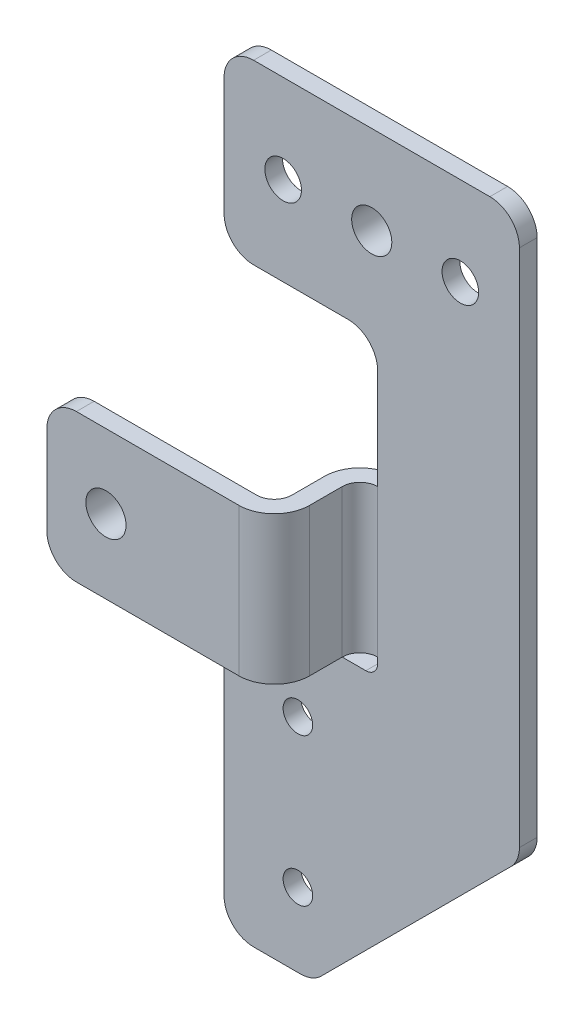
ISO-10303-21;
HEADER;
FILE_DESCRIPTION(('STEP AP214'),'2;1');
FILE_NAME('part.step','',(''),(''),'','','');
FILE_SCHEMA(('AUTOMOTIVE_DESIGN { 1 0 10303 214 1 1 1 1 }'));
ENDSEC;
DATA;
#1=APPLICATION_CONTEXT('core data for automotive mechanical design processes');
#2=APPLICATION_PROTOCOL_DEFINITION('international standard','automotive_design',2000,#1);
#3=PRODUCT_CONTEXT('',#1,'mechanical');
#4=PRODUCT('Part','Part','',(#3));
#5=PRODUCT_RELATED_PRODUCT_CATEGORY('part','',(#4));
#6=PRODUCT_DEFINITION_FORMATION('','',#4);
#7=PRODUCT_DEFINITION_CONTEXT('part definition',#1,'design');
#8=PRODUCT_DEFINITION('design','',#6,#7);
#9=PRODUCT_DEFINITION_SHAPE('','',#8);
#10=(LENGTH_UNIT() NAMED_UNIT(*) SI_UNIT(.MILLI.,.METRE.));
#11=(NAMED_UNIT(*) PLANE_ANGLE_UNIT() SI_UNIT($,.RADIAN.));
#12=(NAMED_UNIT(*) SI_UNIT($,.STERADIAN.) SOLID_ANGLE_UNIT());
#13=UNCERTAINTY_MEASURE_WITH_UNIT(LENGTH_MEASURE(1.E-05),#10,'distance_accuracy_value','');
#14=(GEOMETRIC_REPRESENTATION_CONTEXT(3) GLOBAL_UNCERTAINTY_ASSIGNED_CONTEXT((#13)) GLOBAL_UNIT_ASSIGNED_CONTEXT((#10,
#11,#12)) REPRESENTATION_CONTEXT('',''));
#15=CARTESIAN_POINT('',(0.,0.,0.));
#16=DIRECTION('',(0.,0.,1.));
#17=DIRECTION('',(1.,0.,0.));
#18=AXIS2_PLACEMENT_3D('',#15,#16,#17);
#19=CARTESIAN_POINT('',(74.0000000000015,40.5,1067.));
#20=DIRECTION('',(0.,0.,-1.));
#21=DIRECTION('',(-1.,0.,0.));
#22=AXIS2_PLACEMENT_3D('',#19,#20,#21);
#23=CYLINDRICAL_SURFACE('',#22,6.);
#24=CARTESIAN_POINT('',(74.0000000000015,40.5,1067.));
#25=DIRECTION('',(0.,0.,-1.));
#26=DIRECTION('',(-1.,0.,0.));
#27=AXIS2_PLACEMENT_3D('',#24,#25,#26);
#28=CIRCLE('',#27,6.);
#29=CARTESIAN_POINT('',(68.0000000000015,40.5,1067.));
#30=VERTEX_POINT('',#29);
#31=EDGE_CURVE('E244',#30,#30,#28,.F.);
#32=ORIENTED_EDGE('',*,*,#31,.F.);
#33=EDGE_LOOP('',(#32));
#34=FACE_BOUND('',#33,.T.);
#35=CARTESIAN_POINT('',(74.0000000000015,40.5,1063.));
#36=DIRECTION('',(0.,0.,-1.));
#37=DIRECTION('',(-1.,0.,0.));
#38=AXIS2_PLACEMENT_3D('',#35,#36,#37);
#39=CIRCLE('',#38,6.);
#40=CARTESIAN_POINT('',(68.0000000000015,40.5,1063.));
#41=VERTEX_POINT('',#40);
#42=EDGE_CURVE('E20',#41,#41,#39,.T.);
#43=ORIENTED_EDGE('',*,*,#42,.F.);
#44=EDGE_LOOP('',(#43));
#45=FACE_BOUND('',#44,.T.);
#46=ADVANCED_FACE('F17',(#34,#45),#23,.T.);
#47=CARTESIAN_POINT('',(74.0000000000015,40.5,1063.));
#48=DIRECTION('',(0.,0.,-1.));
#49=DIRECTION('',(-1.,0.,0.));
#50=AXIS2_PLACEMENT_3D('',#47,#48,#49);
#51=PLANE('',#50);
#52=ORIENTED_EDGE('',*,*,#42,.T.);
#53=EDGE_LOOP('',(#52));
#54=FACE_BOUND('',#53,.T.);
#55=CARTESIAN_POINT('',(74.0000000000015,40.5,1063.));
#56=DIRECTION('',(0.,0.,1.));
#57=DIRECTION('',(1.,0.,0.));
#58=AXIS2_PLACEMENT_3D('',#55,#56,#57);
#59=CIRCLE('',#58,3.4);
#60=CARTESIAN_POINT('',(77.4000000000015,40.5,1063.));
#61=VERTEX_POINT('',#60);
#62=EDGE_CURVE('E222',#61,#61,#59,.T.);
#63=ORIENTED_EDGE('',*,*,#62,.T.);
#64=EDGE_LOOP('',(#63));
#65=FACE_BOUND('',#64,.T.);
#66=ADVANCED_FACE('F250',(#54,#65),#51,.T.);
#67=CARTESIAN_POINT('',(96.5000000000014,28.,1067.));
#68=DIRECTION('',(0.,0.,-1.));
#69=DIRECTION('',(-1.,0.,0.));
#70=AXIS2_PLACEMENT_3D('',#67,#68,#69);
#71=PLANE('',#70);
#72=DIRECTION('',(1.,0.,0.));
#73=VECTOR('',#72,1.);
#74=CARTESIAN_POINT('',(96.5000000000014,53.,1067.));
#75=LINE('',#74,#73);
#76=CARTESIAN_POINT('',(96.5000000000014,53.,1067.));
#77=VERTEX_POINT('',#76);
#78=CARTESIAN_POINT('',(69.0000000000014,53.,1067.));
#79=VERTEX_POINT('',#78);
#80=EDGE_CURVE('E846',#77,#79,#75,.F.);
#81=ORIENTED_EDGE('',*,*,#80,.F.);
#82=DIRECTION('',(0.,-1.,0.));
#83=VECTOR('',#82,1.);
#84=CARTESIAN_POINT('',(96.5000000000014,28.,1067.));
#85=LINE('',#84,#83);
#86=CARTESIAN_POINT('',(96.5000000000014,28.,1067.));
#87=VERTEX_POINT('',#86);
#88=EDGE_CURVE('E697',#77,#87,#85,.T.);
#89=ORIENTED_EDGE('',*,*,#88,.T.);
#90=DIRECTION('',(1.,0.,0.));
#91=VECTOR('',#90,1.);
#92=CARTESIAN_POINT('',(96.5000000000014,28.,1067.));
#93=LINE('',#92,#91);
#94=CARTESIAN_POINT('',(69.0000000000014,28.,1067.));
#95=VERTEX_POINT('',#94);
#96=EDGE_CURVE('E237',#95,#87,#93,.T.);
#97=ORIENTED_EDGE('',*,*,#96,.F.);
#98=CARTESIAN_POINT('',(69.0000000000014,33.,1067.));
#99=DIRECTION('',(0.,0.,-1.));
#100=DIRECTION('',(-1.,0.,0.));
#101=AXIS2_PLACEMENT_3D('',#98,#99,#100);
#102=CIRCLE('',#101,5.);
#103=CARTESIAN_POINT('',(64.0000000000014,33.,1067.));
#104=VERTEX_POINT('',#103);
#105=EDGE_CURVE('E228',#104,#95,#102,.F.);
#106=ORIENTED_EDGE('',*,*,#105,.F.);
#107=DIRECTION('',(0.,1.,0.));
#108=VECTOR('',#107,1.);
#109=CARTESIAN_POINT('',(64.0000000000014,53.,1067.));
#110=LINE('',#109,#108);
#111=CARTESIAN_POINT('',(64.0000000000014,48.,1067.));
#112=VERTEX_POINT('',#111);
#113=EDGE_CURVE('E212',#112,#104,#110,.F.);
#114=ORIENTED_EDGE('',*,*,#113,.F.);
#115=CARTESIAN_POINT('',(69.0000000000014,48.,1067.));
#116=DIRECTION('',(0.,0.,1.));
#117=DIRECTION('',(1.,0.,0.));
#118=AXIS2_PLACEMENT_3D('',#115,#116,#117);
#119=CIRCLE('',#118,5.);
#120=EDGE_CURVE('E238',#79,#112,#119,.T.);
#121=ORIENTED_EDGE('',*,*,#120,.F.);
#122=EDGE_LOOP('',(#81,#89,#97,#106,#114,#121));
#123=FACE_BOUND('',#122,.T.);
#124=ORIENTED_EDGE('',*,*,#31,.T.);
#125=EDGE_LOOP('',(#124));
#126=FACE_BOUND('',#125,.T.);
#127=ADVANCED_FACE('F234',(#123,#126),#71,.T.);
#128=CARTESIAN_POINT('',(74.0000000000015,40.5,1063.));
#129=DIRECTION('',(0.,0.,1.));
#130=DIRECTION('',(1.,0.,0.));
#131=AXIS2_PLACEMENT_3D('',#128,#129,#130);
#132=CYLINDRICAL_SURFACE('',#131,3.4);
#133=ORIENTED_EDGE('',*,*,#62,.F.);
#134=EDGE_LOOP('',(#133));
#135=FACE_BOUND('',#134,.T.);
#136=CARTESIAN_POINT('',(74.0000000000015,40.5,1070.));
#137=DIRECTION('',(0.,0.,1.));
#138=DIRECTION('',(1.,0.,0.));
#139=AXIS2_PLACEMENT_3D('',#136,#137,#138);
#140=CIRCLE('',#139,3.4);
#141=CARTESIAN_POINT('',(77.4000000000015,40.5,1070.));
#142=VERTEX_POINT('',#141);
#143=EDGE_CURVE('E694',#142,#142,#140,.F.);
#144=ORIENTED_EDGE('',*,*,#143,.F.);
#145=EDGE_LOOP('',(#144));
#146=FACE_BOUND('',#145,.T.);
#147=ADVANCED_FACE('F418',(#135,#146),#132,.F.);
#148=CARTESIAN_POINT('',(64.0000000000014,53.,1067.));
#149=DIRECTION('',(-1.,0.,0.));
#150=DIRECTION('',(0.,0.,1.));
#151=AXIS2_PLACEMENT_3D('',#148,#149,#150);
#152=PLANE('',#151);
#153=DIRECTION('',(0.,1.,0.));
#154=VECTOR('',#153,1.);
#155=CARTESIAN_POINT('',(64.0000000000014,53.,1070.));
#156=LINE('',#155,#154);
#157=CARTESIAN_POINT('',(64.0000000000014,48.,1070.));
#158=VERTEX_POINT('',#157);
#159=CARTESIAN_POINT('',(64.0000000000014,33.,1070.));
#160=VERTEX_POINT('',#159);
#161=EDGE_CURVE('E696',#158,#160,#156,.F.);
#162=ORIENTED_EDGE('',*,*,#161,.F.);
#163=DIRECTION('',(0.,0.,1.));
#164=VECTOR('',#163,1.);
#165=CARTESIAN_POINT('',(64.0000000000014,48.,1067.));
#166=LINE('',#165,#164);
#167=EDGE_CURVE('E218',#112,#158,#166,.T.);
#168=ORIENTED_EDGE('',*,*,#167,.F.);
#169=ORIENTED_EDGE('',*,*,#113,.T.);
#170=DIRECTION('',(0.,0.,-1.));
#171=VECTOR('',#170,1.);
#172=CARTESIAN_POINT('',(64.0000000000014,33.,1070.));
#173=LINE('',#172,#171);
#174=EDGE_CURVE('E216',#160,#104,#173,.T.);
#175=ORIENTED_EDGE('',*,*,#174,.F.);
#176=EDGE_LOOP('',(#162,#168,#169,#175));
#177=FACE_BOUND('',#176,.T.);
#178=ADVANCED_FACE('F215',(#177),#152,.T.);
#179=CARTESIAN_POINT('',(69.0000000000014,33.,1070.));
#180=DIRECTION('',(0.,0.,-1.));
#181=DIRECTION('',(-1.,0.,0.));
#182=AXIS2_PLACEMENT_3D('',#179,#180,#181);
#183=CYLINDRICAL_SURFACE('',#182,5.);
#184=ORIENTED_EDGE('',*,*,#105,.T.);
#185=DIRECTION('',(0.,0.,-1.));
#186=VECTOR('',#185,1.);
#187=CARTESIAN_POINT('',(69.0000000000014,28.,1070.));
#188=LINE('',#187,#186);
#189=CARTESIAN_POINT('',(69.0000000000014,28.,1070.));
#190=VERTEX_POINT('',#189);
#191=EDGE_CURVE('E843',#190,#95,#188,.T.);
#192=ORIENTED_EDGE('',*,*,#191,.F.);
#193=CARTESIAN_POINT('',(69.0000000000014,33.,1070.));
#194=DIRECTION('',(0.,0.,-1.));
#195=DIRECTION('',(-1.,0.,0.));
#196=AXIS2_PLACEMENT_3D('',#193,#194,#195);
#197=CIRCLE('',#196,5.);
#198=EDGE_CURVE('E230',#160,#190,#197,.F.);
#199=ORIENTED_EDGE('',*,*,#198,.F.);
#200=ORIENTED_EDGE('',*,*,#174,.T.);
#201=EDGE_LOOP('',(#184,#192,#199,#200));
#202=FACE_BOUND('',#201,.T.);
#203=ADVANCED_FACE('F226',(#202),#183,.T.);
#204=CARTESIAN_POINT('',(69.0000000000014,48.,1067.));
#205=DIRECTION('',(0.,0.,1.));
#206=DIRECTION('',(1.,0.,0.));
#207=AXIS2_PLACEMENT_3D('',#204,#205,#206);
#208=CYLINDRICAL_SURFACE('',#207,5.);
#209=CARTESIAN_POINT('',(69.0000000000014,48.,1070.));
#210=DIRECTION('',(0.,0.,1.));
#211=DIRECTION('',(1.,0.,0.));
#212=AXIS2_PLACEMENT_3D('',#209,#210,#211);
#213=CIRCLE('',#212,5.);
#214=CARTESIAN_POINT('',(69.0000000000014,53.,1070.));
#215=VERTEX_POINT('',#214);
#216=EDGE_CURVE('E704',#215,#158,#213,.T.);
#217=ORIENTED_EDGE('',*,*,#216,.F.);
#218=DIRECTION('',(0.,0.,1.));
#219=VECTOR('',#218,1.);
#220=CARTESIAN_POINT('',(69.0000000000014,53.,1067.));
#221=LINE('',#220,#219);
#222=EDGE_CURVE('E699',#79,#215,#221,.T.);
#223=ORIENTED_EDGE('',*,*,#222,.F.);
#224=ORIENTED_EDGE('',*,*,#120,.T.);
#225=ORIENTED_EDGE('',*,*,#167,.T.);
#226=EDGE_LOOP('',(#217,#223,#224,#225));
#227=FACE_BOUND('',#226,.T.);
#228=ADVANCED_FACE('F409',(#227),#208,.T.);
#229=CARTESIAN_POINT('',(96.5000000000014,28.,1064.));
#230=DIRECTION('',(0.,-1.,0.));
#231=DIRECTION('',(0.,0.,-1.));
#232=AXIS2_PLACEMENT_3D('',#229,#230,#231);
#233=CYLINDRICAL_SURFACE('',#232,3.);
#234=CARTESIAN_POINT('',(96.5000000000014,28.,1064.));
#235=DIRECTION('',(0.,-1.,0.));
#236=DIRECTION('',(0.,0.,-1.));
#237=AXIS2_PLACEMENT_3D('',#234,#235,#236);
#238=CIRCLE('',#237,3.);
#239=CARTESIAN_POINT('',(99.5000000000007,28.,1064.));
#240=VERTEX_POINT('',#239);
#241=EDGE_CURVE('E707',#87,#240,#238,.F.);
#242=ORIENTED_EDGE('',*,*,#241,.F.);
#243=ORIENTED_EDGE('',*,*,#88,.F.);
#244=CARTESIAN_POINT('',(96.5000000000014,53.,1064.));
#245=DIRECTION('',(0.,-1.,0.));
#246=DIRECTION('',(0.,0.,-1.));
#247=AXIS2_PLACEMENT_3D('',#244,#245,#246);
#248=CIRCLE('',#247,3.);
#249=CARTESIAN_POINT('',(99.5000000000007,53.,1064.));
#250=VERTEX_POINT('',#249);
#251=EDGE_CURVE('E710',#250,#77,#248,.T.);
#252=ORIENTED_EDGE('',*,*,#251,.F.);
#253=DIRECTION('',(0.,1.,0.));
#254=VECTOR('',#253,1.);
#255=CARTESIAN_POINT('',(99.5,28.,1064.));
#256=LINE('',#255,#254);
#257=EDGE_CURVE('E713',#240,#250,#256,.T.);
#258=ORIENTED_EDGE('',*,*,#257,.F.);
#259=EDGE_LOOP('',(#242,#243,#252,#258));
#260=FACE_BOUND('',#259,.T.);
#261=ADVANCED_FACE('F405',(#260),#233,.F.);
#262=CARTESIAN_POINT('',(96.5000000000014,53.,1070.));
#263=DIRECTION('',(0.,0.,1.));
#264=DIRECTION('',(1.,0.,0.));
#265=AXIS2_PLACEMENT_3D('',#262,#263,#264);
#266=PLANE('',#265);
#267=DIRECTION('',(1.,0.,0.));
#268=VECTOR('',#267,1.);
#269=CARTESIAN_POINT('',(96.5000000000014,53.,1070.));
#270=LINE('',#269,#268);
#271=CARTESIAN_POINT('',(96.5000000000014,53.,1070.));
#272=VERTEX_POINT('',#271);
#273=EDGE_CURVE('E708',#272,#215,#270,.F.);
#274=ORIENTED_EDGE('',*,*,#273,.T.);
#275=ORIENTED_EDGE('',*,*,#216,.T.);
#276=ORIENTED_EDGE('',*,*,#161,.T.);
#277=ORIENTED_EDGE('',*,*,#198,.T.);
#278=DIRECTION('',(1.,0.,0.));
#279=VECTOR('',#278,1.);
#280=CARTESIAN_POINT('',(96.5000000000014,28.,1070.));
#281=LINE('',#280,#279);
#282=CARTESIAN_POINT('',(96.5000000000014,28.,1070.));
#283=VERTEX_POINT('',#282);
#284=EDGE_CURVE('E703',#190,#283,#281,.T.);
#285=ORIENTED_EDGE('',*,*,#284,.T.);
#286=DIRECTION('',(0.,-1.,0.));
#287=VECTOR('',#286,1.);
#288=CARTESIAN_POINT('',(96.5000000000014,28.,1070.));
#289=LINE('',#288,#287);
#290=EDGE_CURVE('E716',#272,#283,#289,.T.);
#291=ORIENTED_EDGE('',*,*,#290,.F.);
#292=EDGE_LOOP('',(#274,#275,#276,#277,#285,#291));
#293=FACE_BOUND('',#292,.T.);
#294=ORIENTED_EDGE('',*,*,#143,.T.);
#295=EDGE_LOOP('',(#294));
#296=FACE_BOUND('',#295,.T.);
#297=ADVANCED_FACE('F401',(#293,#296),#266,.T.);
#298=CARTESIAN_POINT('',(99.5,28.,1058.5));
#299=DIRECTION('',(-1.,0.,0.));
#300=DIRECTION('',(0.,0.,1.));
#301=AXIS2_PLACEMENT_3D('',#298,#299,#300);
#302=PLANE('',#301);
#303=ORIENTED_EDGE('',*,*,#257,.T.);
#304=DIRECTION('',(0.,0.,1.));
#305=VECTOR('',#304,1.);
#306=CARTESIAN_POINT('',(99.5,53.,1058.5));
#307=LINE('',#306,#305);
#308=CARTESIAN_POINT('',(99.5,53.,1058.5));
#309=VERTEX_POINT('',#308);
#310=EDGE_CURVE('E857',#309,#250,#307,.T.);
#311=ORIENTED_EDGE('',*,*,#310,.F.);
#312=DIRECTION('',(0.,1.,0.));
#313=VECTOR('',#312,1.);
#314=CARTESIAN_POINT('',(99.5,53.,1058.5));
#315=LINE('',#314,#313);
#316=CARTESIAN_POINT('',(99.5000000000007,28.,1058.5));
#317=VERTEX_POINT('',#316);
#318=EDGE_CURVE('E724',#317,#309,#315,.T.);
#319=ORIENTED_EDGE('',*,*,#318,.F.);
#320=DIRECTION('',(0.,0.,-1.));
#321=VECTOR('',#320,1.);
#322=CARTESIAN_POINT('',(99.5000000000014,28.,1058.5));
#323=LINE('',#322,#321);
#324=EDGE_CURVE('E719',#240,#317,#323,.T.);
#325=ORIENTED_EDGE('',*,*,#324,.F.);
#326=EDGE_LOOP('',(#303,#311,#319,#325));
#327=FACE_BOUND('',#326,.T.);
#328=ADVANCED_FACE('F397',(#327),#302,.T.);
#329=CARTESIAN_POINT('',(96.5000000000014,28.,1064.));
#330=DIRECTION('',(0.,-1.,0.));
#331=DIRECTION('',(0.,0.,-1.));
#332=AXIS2_PLACEMENT_3D('',#329,#330,#331);
#333=CYLINDRICAL_SURFACE('',#332,6.);
#334=ORIENTED_EDGE('',*,*,#290,.T.);
#335=CARTESIAN_POINT('',(96.5000000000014,28.,1064.));
#336=DIRECTION('',(0.,-1.,0.));
#337=DIRECTION('',(0.,0.,-1.));
#338=AXIS2_PLACEMENT_3D('',#335,#336,#337);
#339=CIRCLE('',#338,6.);
#340=CARTESIAN_POINT('',(102.500000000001,28.,1064.));
#341=VERTEX_POINT('',#340);
#342=EDGE_CURVE('E717',#283,#341,#339,.F.);
#343=ORIENTED_EDGE('',*,*,#342,.T.);
#344=DIRECTION('',(0.,1.,0.));
#345=VECTOR('',#344,1.);
#346=CARTESIAN_POINT('',(102.5,53.,1064.));
#347=LINE('',#346,#345);
#348=CARTESIAN_POINT('',(102.500000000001,53.,1064.));
#349=VERTEX_POINT('',#348);
#350=EDGE_CURVE('E858',#349,#341,#347,.F.);
#351=ORIENTED_EDGE('',*,*,#350,.F.);
#352=CARTESIAN_POINT('',(96.5000000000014,53.,1064.));
#353=DIRECTION('',(0.,-1.,0.));
#354=DIRECTION('',(0.,0.,-1.));
#355=AXIS2_PLACEMENT_3D('',#352,#353,#354);
#356=CIRCLE('',#355,6.);
#357=EDGE_CURVE('E714',#349,#272,#356,.T.);
#358=ORIENTED_EDGE('',*,*,#357,.T.);
#359=EDGE_LOOP('',(#334,#343,#351,#358));
#360=FACE_BOUND('',#359,.T.);
#361=ADVANCED_FACE('F393',(#360),#333,.T.);
#362=CARTESIAN_POINT('',(105.5,53.,1058.5));
#363=DIRECTION('',(0.,1.,0.));
#364=DIRECTION('',(0.,0.,1.));
#365=AXIS2_PLACEMENT_3D('',#362,#363,#364);
#366=CYLINDRICAL_SURFACE('',#365,6.);
#367=ORIENTED_EDGE('',*,*,#318,.T.);
#368=CARTESIAN_POINT('',(105.5,53.,1058.5));
#369=DIRECTION('',(0.,1.,0.));
#370=DIRECTION('',(0.,0.,1.));
#371=AXIS2_PLACEMENT_3D('',#368,#369,#370);
#372=CIRCLE('',#371,6.);
#373=CARTESIAN_POINT('',(105.5,53.,1052.5));
#374=VERTEX_POINT('',#373);
#375=EDGE_CURVE('E727',#374,#309,#372,.T.);
#376=ORIENTED_EDGE('',*,*,#375,.F.);
#377=DIRECTION('',(0.,1.,0.));
#378=VECTOR('',#377,1.);
#379=CARTESIAN_POINT('',(105.5,53.,1052.5));
#380=LINE('',#379,#378);
#381=CARTESIAN_POINT('',(105.5,28.,1052.5));
#382=VERTEX_POINT('',#381);
#383=EDGE_CURVE('E735',#382,#374,#380,.T.);
#384=ORIENTED_EDGE('',*,*,#383,.F.);
#385=CARTESIAN_POINT('',(105.5,28.,1058.5));
#386=DIRECTION('',(0.,1.,0.));
#387=DIRECTION('',(0.,0.,1.));
#388=AXIS2_PLACEMENT_3D('',#385,#386,#387);
#389=CIRCLE('',#388,6.);
#390=EDGE_CURVE('E723',#317,#382,#389,.F.);
#391=ORIENTED_EDGE('',*,*,#390,.F.);
#392=EDGE_LOOP('',(#367,#376,#384,#391));
#393=FACE_BOUND('',#392,.T.);
#394=ADVANCED_FACE('F389',(#393),#366,.T.);
#395=CARTESIAN_POINT('',(104.5,90.,1052.5));
#396=DIRECTION('',(0.,0.,-1.));
#397=DIRECTION('',(-1.,0.,0.));
#398=AXIS2_PLACEMENT_3D('',#395,#396,#397);
#399=CYLINDRICAL_SURFACE('',#398,6.);
#400=CARTESIAN_POINT('',(104.5,90.,1052.5));
#401=DIRECTION('',(0.,0.,-1.));
#402=DIRECTION('',(-1.,0.,0.));
#403=AXIS2_PLACEMENT_3D('',#400,#401,#402);
#404=CIRCLE('',#403,6.);
#405=CARTESIAN_POINT('',(98.5,90.,1052.5));
#406=VERTEX_POINT('',#405);
#407=EDGE_CURVE('E731',#406,#406,#404,.F.);
#408=ORIENTED_EDGE('',*,*,#407,.F.);
#409=EDGE_LOOP('',(#408));
#410=FACE_BOUND('',#409,.T.);
#411=CARTESIAN_POINT('',(104.5,90.,1048.5));
#412=DIRECTION('',(0.,0.,-1.));
#413=DIRECTION('',(-1.,0.,0.));
#414=AXIS2_PLACEMENT_3D('',#411,#412,#413);
#415=CIRCLE('',#414,6.);
#416=CARTESIAN_POINT('',(98.5,90.,1048.5));
#417=VERTEX_POINT('',#416);
#418=EDGE_CURVE('E720',#417,#417,#415,.T.);
#419=ORIENTED_EDGE('',*,*,#418,.F.);
#420=EDGE_LOOP('',(#419));
#421=FACE_BOUND('',#420,.T.);
#422=ADVANCED_FACE('F385',(#410,#421),#399,.T.);
#423=CARTESIAN_POINT('',(104.5,90.,1048.5));
#424=DIRECTION('',(0.,0.,-1.));
#425=DIRECTION('',(-1.,0.,0.));
#426=AXIS2_PLACEMENT_3D('',#423,#424,#425);
#427=PLANE('',#426);
#428=ORIENTED_EDGE('',*,*,#418,.T.);
#429=EDGE_LOOP('',(#428));
#430=FACE_BOUND('',#429,.T.);
#431=CARTESIAN_POINT('',(104.5,90.,1048.5));
#432=DIRECTION('',(0.,0.,1.));
#433=DIRECTION('',(1.,0.,0.));
#434=AXIS2_PLACEMENT_3D('',#431,#432,#433);
#435=CIRCLE('',#434,3.4);
#436=CARTESIAN_POINT('',(107.9,90.,1048.5));
#437=VERTEX_POINT('',#436);
#438=EDGE_CURVE('E741',#437,#437,#435,.T.);
#439=ORIENTED_EDGE('',*,*,#438,.T.);
#440=EDGE_LOOP('',(#439));
#441=FACE_BOUND('',#440,.T.);
#442=ADVANCED_FACE('F381',(#430,#441),#427,.T.);
#443=CARTESIAN_POINT('',(105.5,28.,1058.5));
#444=DIRECTION('',(0.,-1.,0.));
#445=DIRECTION('',(0.,0.,-1.));
#446=AXIS2_PLACEMENT_3D('',#443,#444,#445);
#447=PLANE('',#446);
#448=DIRECTION('',(0.,0.,1.));
#449=VECTOR('',#448,1.);
#450=CARTESIAN_POINT('',(105.5,28.,1052.5));
#451=LINE('',#450,#449);
#452=CARTESIAN_POINT('',(105.5,28.,1055.5));
#453=VERTEX_POINT('',#452);
#454=EDGE_CURVE('E864',#453,#382,#451,.F.);
#455=ORIENTED_EDGE('',*,*,#454,.F.);
#456=CARTESIAN_POINT('',(105.5,28.,1058.5));
#457=DIRECTION('',(0.,1.,0.));
#458=DIRECTION('',(0.,0.,1.));
#459=AXIS2_PLACEMENT_3D('',#456,#457,#458);
#460=CIRCLE('',#459,3.);
#461=CARTESIAN_POINT('',(102.5,28.,1058.5));
#462=VERTEX_POINT('',#461);
#463=EDGE_CURVE('E750',#453,#462,#460,.T.);
#464=ORIENTED_EDGE('',*,*,#463,.T.);
#465=DIRECTION('',(0.,0.,-1.));
#466=VECTOR('',#465,1.);
#467=CARTESIAN_POINT('',(102.5,28.,1058.5));
#468=LINE('',#467,#466);
#469=EDGE_CURVE('E730',#341,#462,#468,.T.);
#470=ORIENTED_EDGE('',*,*,#469,.F.);
#471=ORIENTED_EDGE('',*,*,#342,.F.);
#472=ORIENTED_EDGE('',*,*,#284,.F.);
#473=ORIENTED_EDGE('',*,*,#191,.T.);
#474=ORIENTED_EDGE('',*,*,#96,.T.);
#475=ORIENTED_EDGE('',*,*,#241,.T.);
#476=ORIENTED_EDGE('',*,*,#324,.T.);
#477=ORIENTED_EDGE('',*,*,#390,.T.);
#478=EDGE_LOOP('',(#455,#464,#470,#471,#472,#473,#474,#475,#476,#477));
#479=FACE_BOUND('',#478,.T.);
#480=ADVANCED_FACE('F377',(#479),#447,.T.);
#481=CARTESIAN_POINT('',(102.5,53.,1058.5));
#482=DIRECTION('',(1.,0.,0.));
#483=DIRECTION('',(0.,0.,-1.));
#484=AXIS2_PLACEMENT_3D('',#481,#482,#483);
#485=PLANE('',#484);
#486=ORIENTED_EDGE('',*,*,#350,.T.);
#487=ORIENTED_EDGE('',*,*,#469,.T.);
#488=DIRECTION('',(0.,1.,0.));
#489=VECTOR('',#488,1.);
#490=CARTESIAN_POINT('',(102.5,53.,1058.5));
#491=LINE('',#490,#489);
#492=CARTESIAN_POINT('',(102.5,53.,1058.5));
#493=VERTEX_POINT('',#492);
#494=EDGE_CURVE('E753',#462,#493,#491,.T.);
#495=ORIENTED_EDGE('',*,*,#494,.T.);
#496=DIRECTION('',(0.,0.,-1.));
#497=VECTOR('',#496,1.);
#498=CARTESIAN_POINT('',(102.5,53.,1058.5));
#499=LINE('',#498,#497);
#500=EDGE_CURVE('E726',#493,#349,#499,.F.);
#501=ORIENTED_EDGE('',*,*,#500,.T.);
#502=EDGE_LOOP('',(#486,#487,#495,#501));
#503=FACE_BOUND('',#502,.T.);
#504=ADVANCED_FACE('F373',(#503),#485,.T.);
#505=CARTESIAN_POINT('',(105.5,53.,1058.5));
#506=DIRECTION('',(0.,1.,0.));
#507=DIRECTION('',(0.,0.,1.));
#508=AXIS2_PLACEMENT_3D('',#505,#506,#507);
#509=PLANE('',#508);
#510=ORIENTED_EDGE('',*,*,#375,.T.);
#511=ORIENTED_EDGE('',*,*,#310,.T.);
#512=ORIENTED_EDGE('',*,*,#251,.T.);
#513=ORIENTED_EDGE('',*,*,#80,.T.);
#514=ORIENTED_EDGE('',*,*,#222,.T.);
#515=ORIENTED_EDGE('',*,*,#273,.F.);
#516=ORIENTED_EDGE('',*,*,#357,.F.);
#517=ORIENTED_EDGE('',*,*,#500,.F.);
#518=CARTESIAN_POINT('',(105.5,53.,1058.5));
#519=DIRECTION('',(0.,1.,0.));
#520=DIRECTION('',(0.,0.,1.));
#521=AXIS2_PLACEMENT_3D('',#518,#519,#520);
#522=CIRCLE('',#521,3.);
#523=CARTESIAN_POINT('',(105.5,53.,1055.5));
#524=VERTEX_POINT('',#523);
#525=EDGE_CURVE('E754',#493,#524,#522,.F.);
#526=ORIENTED_EDGE('',*,*,#525,.T.);
#527=DIRECTION('',(0.,0.,-1.));
#528=VECTOR('',#527,1.);
#529=CARTESIAN_POINT('',(105.5,53.,1052.5));
#530=LINE('',#529,#528);
#531=EDGE_CURVE('E757',#524,#374,#530,.T.);
#532=ORIENTED_EDGE('',*,*,#531,.T.);
#533=EDGE_LOOP('',(#510,#511,#512,#513,#514,#515,#516,#517,#526,#532));
#534=FACE_BOUND('',#533,.T.);
#535=ADVANCED_FACE('F369',(#534),#509,.T.);
#536=CARTESIAN_POINT('',(105.5,28.,1052.5));
#537=DIRECTION('',(-1.,0.,0.));
#538=DIRECTION('',(0.,-1.,0.));
#539=AXIS2_PLACEMENT_3D('',#536,#537,#538);
#540=PLANE('',#539);
#541=DIRECTION('',(0.,-1.,0.));
#542=VECTOR('',#541,1.);
#543=CARTESIAN_POINT('',(105.5,28.,1055.5));
#544=LINE('',#543,#542);
#545=CARTESIAN_POINT('',(105.5,27.,1055.5));
#546=VERTEX_POINT('',#545);
#547=EDGE_CURVE('E35',#546,#453,#544,.F.);
#548=ORIENTED_EDGE('',*,*,#547,.T.);
#549=ORIENTED_EDGE('',*,*,#454,.T.);
#550=DIRECTION('',(0.,1.,0.));
#551=VECTOR('',#550,1.);
#552=CARTESIAN_POINT('',(105.5,53.,1052.5));
#553=LINE('',#552,#551);
#554=CARTESIAN_POINT('',(105.5,27.,1052.5));
#555=VERTEX_POINT('',#554);
#556=EDGE_CURVE('E867',#555,#382,#553,.T.);
#557=ORIENTED_EDGE('',*,*,#556,.F.);
#558=DIRECTION('',(0.,0.,-1.));
#559=VECTOR('',#558,1.);
#560=CARTESIAN_POINT('',(105.5,27.,1052.5));
#561=LINE('',#560,#559);
#562=EDGE_CURVE('E917',#555,#546,#561,.F.);
#563=ORIENTED_EDGE('',*,*,#562,.T.);
#564=EDGE_LOOP('',(#548,#549,#557,#563));
#565=FACE_BOUND('',#564,.T.);
#566=ADVANCED_FACE('F365',(#565),#540,.T.);
#567=CARTESIAN_POINT('',(79.5,53.,1052.5));
#568=DIRECTION('',(0.,0.,-1.));
#569=DIRECTION('',(-1.,0.,0.));
#570=AXIS2_PLACEMENT_3D('',#567,#568,#569);
#571=PLANE('',#570);
#572=CARTESIAN_POINT('',(92.,-12.5,1052.5));
#573=DIRECTION('',(0.,0.,-1.));
#574=DIRECTION('',(-1.,0.,0.));
#575=AXIS2_PLACEMENT_3D('',#572,#573,#574);
#576=CIRCLE('',#575,2.5);
#577=CARTESIAN_POINT('',(89.5,-12.5,1052.5));
#578=VERTEX_POINT('',#577);
#579=EDGE_CURVE('E747',#578,#578,#576,.F.);
#580=ORIENTED_EDGE('',*,*,#579,.T.);
#581=EDGE_LOOP('',(#580));
#582=FACE_BOUND('',#581,.T.);
#583=CARTESIAN_POINT('',(92.,12.5,1052.5));
#584=DIRECTION('',(0.,0.,-1.));
#585=DIRECTION('',(-1.,0.,0.));
#586=AXIS2_PLACEMENT_3D('',#583,#584,#585);
#587=CIRCLE('',#586,2.5);
#588=CARTESIAN_POINT('',(89.5,12.5,1052.5));
#589=VERTEX_POINT('',#588);
#590=EDGE_CURVE('E744',#589,#589,#587,.F.);
#591=ORIENTED_EDGE('',*,*,#590,.T.);
#592=EDGE_LOOP('',(#591));
#593=FACE_BOUND('',#592,.T.);
#594=ORIENTED_EDGE('',*,*,#407,.T.);
#595=EDGE_LOOP('',(#594));
#596=FACE_BOUND('',#595,.T.);
#597=CARTESIAN_POINT('',(119.5,90.,1052.5));
#598=DIRECTION('',(0.,0.,-1.));
#599=DIRECTION('',(-1.,0.,0.));
#600=AXIS2_PLACEMENT_3D('',#597,#598,#599);
#601=CIRCLE('',#600,3.1);
#602=CARTESIAN_POINT('',(116.4,90.,1052.5));
#603=VERTEX_POINT('',#602);
#604=EDGE_CURVE('E738',#603,#603,#601,.F.);
#605=ORIENTED_EDGE('',*,*,#604,.T.);
#606=EDGE_LOOP('',(#605));
#607=FACE_BOUND('',#606,.T.);
#608=CARTESIAN_POINT('',(89.5,90.,1052.5));
#609=DIRECTION('',(0.,0.,-1.));
#610=DIRECTION('',(-1.,0.,0.));
#611=AXIS2_PLACEMENT_3D('',#608,#609,#610);
#612=CIRCLE('',#611,3.1);
#613=CARTESIAN_POINT('',(86.4,90.,1052.5));
#614=VERTEX_POINT('',#613);
#615=EDGE_CURVE('E734',#614,#614,#612,.F.);
#616=ORIENTED_EDGE('',*,*,#615,.T.);
#617=EDGE_LOOP('',(#616));
#618=FACE_BOUND('',#617,.T.);
#619=DIRECTION('',(1.,0.,0.));
#620=VECTOR('',#619,1.);
#621=CARTESIAN_POINT('',(129.5,-25.,1052.5));
#622=LINE('',#621,#620);
#623=CARTESIAN_POINT('',(84.5,-25.,1052.5));
#624=VERTEX_POINT('',#623);
#625=CARTESIAN_POINT('',(92.4289321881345,-25.,1052.5));
#626=VERTEX_POINT('',#625);
#627=EDGE_CURVE('E885',#624,#626,#622,.T.);
#628=ORIENTED_EDGE('',*,*,#627,.F.);
#629=CARTESIAN_POINT('',(84.5,-20.,1052.5));
#630=DIRECTION('',(0.,0.,-1.));
#631=DIRECTION('',(-1.,0.,0.));
#632=AXIS2_PLACEMENT_3D('',#629,#630,#631);
#633=CIRCLE('',#632,5.);
#634=CARTESIAN_POINT('',(79.5,-20.,1052.5));
#635=VERTEX_POINT('',#634);
#636=EDGE_CURVE('E783',#635,#624,#633,.F.);
#637=ORIENTED_EDGE('',*,*,#636,.F.);
#638=DIRECTION('',(0.,-1.,0.));
#639=VECTOR('',#638,1.);
#640=CARTESIAN_POINT('',(79.5,-25.,1052.5));
#641=LINE('',#640,#639);
#642=CARTESIAN_POINT('',(79.5,20.,1052.5));
#643=VERTEX_POINT('',#642);
#644=EDGE_CURVE('E887',#643,#635,#641,.T.);
#645=ORIENTED_EDGE('',*,*,#644,.F.);
#646=CARTESIAN_POINT('',(84.5,20.,1052.5));
#647=DIRECTION('',(0.,0.,1.));
#648=DIRECTION('',(1.,0.,0.));
#649=AXIS2_PLACEMENT_3D('',#646,#647,#648);
#650=CIRCLE('',#649,5.);
#651=CARTESIAN_POINT('',(84.5,25.,1052.5));
#652=VERTEX_POINT('',#651);
#653=EDGE_CURVE('E787',#652,#643,#650,.T.);
#654=ORIENTED_EDGE('',*,*,#653,.F.);
#655=DIRECTION('',(-1.,0.,0.));
#656=VECTOR('',#655,1.);
#657=CARTESIAN_POINT('',(105.5,25.,1052.5));
#658=LINE('',#657,#656);
#659=CARTESIAN_POINT('',(103.5,25.,1052.5));
#660=VERTEX_POINT('',#659);
#661=EDGE_CURVE('E890',#660,#652,#658,.T.);
#662=ORIENTED_EDGE('',*,*,#661,.F.);
#663=CARTESIAN_POINT('',(103.5,27.,1052.5));
#664=DIRECTION('',(0.,0.,-1.));
#665=DIRECTION('',(-1.,0.,0.));
#666=AXIS2_PLACEMENT_3D('',#663,#664,#665);
#667=CIRCLE('',#666,2.);
#668=EDGE_CURVE('E791',#660,#555,#667,.F.);
#669=ORIENTED_EDGE('',*,*,#668,.T.);
#670=ORIENTED_EDGE('',*,*,#556,.T.);
#671=ORIENTED_EDGE('',*,*,#383,.T.);
#672=DIRECTION('',(0.,1.,0.));
#673=VECTOR('',#672,1.);
#674=CARTESIAN_POINT('',(105.5,53.,1052.5));
#675=LINE('',#674,#673);
#676=CARTESIAN_POINT('',(105.5,70.,1052.5));
#677=VERTEX_POINT('',#676);
#678=EDGE_CURVE('E873',#374,#677,#675,.T.);
#679=ORIENTED_EDGE('',*,*,#678,.T.);
#680=CARTESIAN_POINT('',(100.5,70.,1052.5));
#681=DIRECTION('',(0.,0.,1.));
#682=DIRECTION('',(1.,0.,0.));
#683=AXIS2_PLACEMENT_3D('',#680,#681,#682);
#684=CIRCLE('',#683,5.);
#685=CARTESIAN_POINT('',(100.5,75.,1052.5));
#686=VERTEX_POINT('',#685);
#687=EDGE_CURVE('E758',#677,#686,#684,.T.);
#688=ORIENTED_EDGE('',*,*,#687,.T.);
#689=DIRECTION('',(1.,0.,0.));
#690=VECTOR('',#689,1.);
#691=CARTESIAN_POINT('',(79.5,75.,1052.5));
#692=LINE('',#691,#690);
#693=CARTESIAN_POINT('',(84.5,75.,1052.5));
#694=VERTEX_POINT('',#693);
#695=EDGE_CURVE('E761',#694,#686,#692,.T.);
#696=ORIENTED_EDGE('',*,*,#695,.F.);
#697=CARTESIAN_POINT('',(84.5,80.,1052.5));
#698=DIRECTION('',(0.,0.,1.));
#699=DIRECTION('',(1.,0.,0.));
#700=AXIS2_PLACEMENT_3D('',#697,#698,#699);
#701=CIRCLE('',#700,5.);
#702=CARTESIAN_POINT('',(79.5,80.,1052.5));
#703=VERTEX_POINT('',#702);
#704=EDGE_CURVE('E763',#703,#694,#701,.T.);
#705=ORIENTED_EDGE('',*,*,#704,.F.);
#706=DIRECTION('',(0.,1.,0.));
#707=VECTOR('',#706,1.);
#708=CARTESIAN_POINT('',(79.5,53.,1052.5));
#709=LINE('',#708,#707);
#710=CARTESIAN_POINT('',(79.5,100.,1052.5));
#711=VERTEX_POINT('',#710);
#712=EDGE_CURVE('E876',#711,#703,#709,.F.);
#713=ORIENTED_EDGE('',*,*,#712,.F.);
#714=CARTESIAN_POINT('',(84.5,100.,1052.5));
#715=DIRECTION('',(0.,0.,-1.));
#716=DIRECTION('',(-1.,0.,0.));
#717=AXIS2_PLACEMENT_3D('',#714,#715,#716);
#718=CIRCLE('',#717,5.);
#719=CARTESIAN_POINT('',(84.5,105.,1052.5));
#720=VERTEX_POINT('',#719);
#721=EDGE_CURVE('E767',#720,#711,#718,.F.);
#722=ORIENTED_EDGE('',*,*,#721,.F.);
#723=DIRECTION('',(1.,0.,0.));
#724=VECTOR('',#723,1.);
#725=CARTESIAN_POINT('',(79.5,105.,1052.5));
#726=LINE('',#725,#724);
#727=CARTESIAN_POINT('',(124.5,105.,1052.5));
#728=VERTEX_POINT('',#727);
#729=EDGE_CURVE('E878',#728,#720,#726,.F.);
#730=ORIENTED_EDGE('',*,*,#729,.F.);
#731=CARTESIAN_POINT('',(124.5,100.,1052.5));
#732=DIRECTION('',(0.,0.,-1.));
#733=DIRECTION('',(-1.,0.,0.));
#734=AXIS2_PLACEMENT_3D('',#731,#732,#733);
#735=CIRCLE('',#734,5.);
#736=CARTESIAN_POINT('',(129.5,100.,1052.5));
#737=VERTEX_POINT('',#736);
#738=EDGE_CURVE('E771',#737,#728,#735,.F.);
#739=ORIENTED_EDGE('',*,*,#738,.F.);
#740=DIRECTION('',(0.,1.,0.));
#741=VECTOR('',#740,1.);
#742=CARTESIAN_POINT('',(129.5,105.,1052.5));
#743=LINE('',#742,#741);
#744=CARTESIAN_POINT('',(129.5,12.0710678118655,1052.5));
#745=VERTEX_POINT('',#744);
#746=EDGE_CURVE('E880',#745,#737,#743,.T.);
#747=ORIENTED_EDGE('',*,*,#746,.F.);
#748=CARTESIAN_POINT('',(124.5,12.0710678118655,1052.5));
#749=DIRECTION('',(0.,0.,1.));
#750=DIRECTION('',(1.,0.,0.));
#751=AXIS2_PLACEMENT_3D('',#748,#749,#750);
#752=CIRCLE('',#751,5.);
#753=CARTESIAN_POINT('',(128.035533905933,8.5355339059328,1052.5));
#754=VERTEX_POINT('',#753);
#755=EDGE_CURVE('E775',#754,#745,#752,.T.);
#756=ORIENTED_EDGE('',*,*,#755,.F.);
#757=DIRECTION('',(-0.707106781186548,-0.707106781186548,0.));
#758=VECTOR('',#757,1.);
#759=CARTESIAN_POINT('',(129.5,10.,1052.5));
#760=LINE('',#759,#758);
#761=CARTESIAN_POINT('',(95.9644660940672,-23.5355339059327,1052.5));
#762=VERTEX_POINT('',#761);
#763=EDGE_CURVE('E782',#754,#762,#760,.T.);
#764=ORIENTED_EDGE('',*,*,#763,.T.);
#765=CARTESIAN_POINT('',(92.4289321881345,-20.,1052.5));
#766=DIRECTION('',(0.,0.,-1.));
#767=DIRECTION('',(-1.,0.,0.));
#768=AXIS2_PLACEMENT_3D('',#765,#766,#767);
#769=CIRCLE('',#768,5.);
#770=EDGE_CURVE('E779',#626,#762,#769,.F.);
#771=ORIENTED_EDGE('',*,*,#770,.F.);
#772=EDGE_LOOP('',(#628,#637,#645,#654,#662,#669,#670,#671,#679,#688,#696,#705,#713,#722,#730,
#739,#747,#756,#764,#771));
#773=FACE_BOUND('',#772,.T.);
#774=ADVANCED_FACE('F361',(#582,#593,#596,#607,#618,#773),#571,.T.);
#775=CARTESIAN_POINT('',(89.5,90.,1055.5));
#776=DIRECTION('',(0.,0.,-1.));
#777=DIRECTION('',(-1.,0.,0.));
#778=AXIS2_PLACEMENT_3D('',#775,#776,#777);
#779=CYLINDRICAL_SURFACE('',#778,3.1);
#780=CARTESIAN_POINT('',(89.5,90.,1055.5));
#781=DIRECTION('',(0.,0.,-1.));
#782=DIRECTION('',(-1.,0.,0.));
#783=AXIS2_PLACEMENT_3D('',#780,#781,#782);
#784=CIRCLE('',#783,3.1);
#785=CARTESIAN_POINT('',(86.4,90.,1055.5));
#786=VERTEX_POINT('',#785);
#787=EDGE_CURVE('E794',#786,#786,#784,.F.);
#788=ORIENTED_EDGE('',*,*,#787,.T.);
#789=EDGE_LOOP('',(#788));
#790=FACE_BOUND('',#789,.T.);
#791=ORIENTED_EDGE('',*,*,#615,.F.);
#792=EDGE_LOOP('',(#791));
#793=FACE_BOUND('',#792,.T.);
#794=ADVANCED_FACE('F357',(#790,#793),#779,.F.);
#795=CARTESIAN_POINT('',(119.5,90.,1055.5));
#796=DIRECTION('',(0.,0.,-1.));
#797=DIRECTION('',(-1.,0.,0.));
#798=AXIS2_PLACEMENT_3D('',#795,#796,#797);
#799=CYLINDRICAL_SURFACE('',#798,3.1);
#800=CARTESIAN_POINT('',(119.5,90.,1055.5));
#801=DIRECTION('',(0.,0.,-1.));
#802=DIRECTION('',(-1.,0.,0.));
#803=AXIS2_PLACEMENT_3D('',#800,#801,#802);
#804=CIRCLE('',#803,3.1);
#805=CARTESIAN_POINT('',(116.4,90.,1055.5));
#806=VERTEX_POINT('',#805);
#807=EDGE_CURVE('E798',#806,#806,#804,.F.);
#808=ORIENTED_EDGE('',*,*,#807,.T.);
#809=EDGE_LOOP('',(#808));
#810=FACE_BOUND('',#809,.T.);
#811=ORIENTED_EDGE('',*,*,#604,.F.);
#812=EDGE_LOOP('',(#811));
#813=FACE_BOUND('',#812,.T.);
#814=ADVANCED_FACE('F353',(#810,#813),#799,.F.);
#815=CARTESIAN_POINT('',(104.5,90.,1048.5));
#816=DIRECTION('',(0.,0.,1.));
#817=DIRECTION('',(1.,0.,0.));
#818=AXIS2_PLACEMENT_3D('',#815,#816,#817);
#819=CYLINDRICAL_SURFACE('',#818,3.4);
#820=CARTESIAN_POINT('',(104.5,90.,1055.5));
#821=DIRECTION('',(0.,0.,1.));
#822=DIRECTION('',(1.,0.,0.));
#823=AXIS2_PLACEMENT_3D('',#820,#821,#822);
#824=CIRCLE('',#823,3.4);
#825=CARTESIAN_POINT('',(107.9,90.,1055.5));
#826=VERTEX_POINT('',#825);
#827=EDGE_CURVE('E801',#826,#826,#824,.T.);
#828=ORIENTED_EDGE('',*,*,#827,.T.);
#829=EDGE_LOOP('',(#828));
#830=FACE_BOUND('',#829,.T.);
#831=ORIENTED_EDGE('',*,*,#438,.F.);
#832=EDGE_LOOP('',(#831));
#833=FACE_BOUND('',#832,.T.);
#834=ADVANCED_FACE('F349',(#830,#833),#819,.F.);
#835=CARTESIAN_POINT('',(92.,12.5,1055.5));
#836=DIRECTION('',(0.,0.,-1.));
#837=DIRECTION('',(-1.,0.,0.));
#838=AXIS2_PLACEMENT_3D('',#835,#836,#837);
#839=CYLINDRICAL_SURFACE('',#838,2.5);
#840=CARTESIAN_POINT('',(92.,12.5,1055.5));
#841=DIRECTION('',(0.,0.,-1.));
#842=DIRECTION('',(-1.,0.,0.));
#843=AXIS2_PLACEMENT_3D('',#840,#841,#842);
#844=CIRCLE('',#843,2.5);
#845=CARTESIAN_POINT('',(89.5,12.5,1055.5));
#846=VERTEX_POINT('',#845);
#847=EDGE_CURVE('E804',#846,#846,#844,.F.);
#848=ORIENTED_EDGE('',*,*,#847,.T.);
#849=EDGE_LOOP('',(#848));
#850=FACE_BOUND('',#849,.T.);
#851=ORIENTED_EDGE('',*,*,#590,.F.);
#852=EDGE_LOOP('',(#851));
#853=FACE_BOUND('',#852,.T.);
#854=ADVANCED_FACE('F345',(#850,#853),#839,.F.);
#855=CARTESIAN_POINT('',(92.,-12.5,1055.5));
#856=DIRECTION('',(0.,0.,-1.));
#857=DIRECTION('',(-1.,0.,0.));
#858=AXIS2_PLACEMENT_3D('',#855,#856,#857);
#859=CYLINDRICAL_SURFACE('',#858,2.5);
#860=CARTESIAN_POINT('',(92.,-12.5,1055.5));
#861=DIRECTION('',(0.,0.,-1.));
#862=DIRECTION('',(-1.,0.,0.));
#863=AXIS2_PLACEMENT_3D('',#860,#861,#862);
#864=CIRCLE('',#863,2.5);
#865=CARTESIAN_POINT('',(89.5,-12.5,1055.5));
#866=VERTEX_POINT('',#865);
#867=EDGE_CURVE('E807',#866,#866,#864,.F.);
#868=ORIENTED_EDGE('',*,*,#867,.T.);
#869=EDGE_LOOP('',(#868));
#870=FACE_BOUND('',#869,.T.);
#871=ORIENTED_EDGE('',*,*,#579,.F.);
#872=EDGE_LOOP('',(#871));
#873=FACE_BOUND('',#872,.T.);
#874=ADVANCED_FACE('F341',(#870,#873),#859,.F.);
#875=CARTESIAN_POINT('',(105.5,53.,1058.5));
#876=DIRECTION('',(0.,1.,0.));
#877=DIRECTION('',(0.,0.,1.));
#878=AXIS2_PLACEMENT_3D('',#875,#876,#877);
#879=CYLINDRICAL_SURFACE('',#878,3.);
#880=ORIENTED_EDGE('',*,*,#525,.F.);
#881=ORIENTED_EDGE('',*,*,#494,.F.);
#882=ORIENTED_EDGE('',*,*,#463,.F.);
#883=DIRECTION('',(0.,1.,0.));
#884=VECTOR('',#883,1.);
#885=CARTESIAN_POINT('',(105.5,53.,1055.5));
#886=LINE('',#885,#884);
#887=EDGE_CURVE('E810',#453,#524,#886,.T.);
#888=ORIENTED_EDGE('',*,*,#887,.T.);
#889=EDGE_LOOP('',(#880,#881,#882,#888));
#890=FACE_BOUND('',#889,.T.);
#891=ADVANCED_FACE('F337',(#890),#879,.F.);
#892=CARTESIAN_POINT('',(105.5,53.,1052.5));
#893=DIRECTION('',(1.,0.,0.));
#894=DIRECTION('',(0.,0.,-1.));
#895=AXIS2_PLACEMENT_3D('',#892,#893,#894);
#896=PLANE('',#895);
#897=DIRECTION('',(0.,0.,1.));
#898=VECTOR('',#897,1.);
#899=CARTESIAN_POINT('',(105.5,70.,1052.5));
#900=LINE('',#899,#898);
#901=CARTESIAN_POINT('',(105.5,70.,1055.5));
#902=VERTEX_POINT('',#901);
#903=EDGE_CURVE('E762',#902,#677,#900,.F.);
#904=ORIENTED_EDGE('',*,*,#903,.T.);
#905=ORIENTED_EDGE('',*,*,#678,.F.);
#906=ORIENTED_EDGE('',*,*,#531,.F.);
#907=DIRECTION('',(0.,1.,0.));
#908=VECTOR('',#907,1.);
#909=CARTESIAN_POINT('',(105.5,53.,1055.5));
#910=LINE('',#909,#908);
#911=EDGE_CURVE('E815',#524,#902,#910,.T.);
#912=ORIENTED_EDGE('',*,*,#911,.T.);
#913=EDGE_LOOP('',(#904,#905,#906,#912));
#914=FACE_BOUND('',#913,.T.);
#915=ADVANCED_FACE('F333',(#914),#896,.F.);
#916=CARTESIAN_POINT('',(100.5,70.,1052.5));
#917=DIRECTION('',(0.,0.,1.));
#918=DIRECTION('',(1.,0.,0.));
#919=AXIS2_PLACEMENT_3D('',#916,#917,#918);
#920=CYLINDRICAL_SURFACE('',#919,5.);
#921=ORIENTED_EDGE('',*,*,#903,.F.);
#922=CARTESIAN_POINT('',(100.5,70.,1055.5));
#923=DIRECTION('',(0.,0.,1.));
#924=DIRECTION('',(1.,0.,0.));
#925=AXIS2_PLACEMENT_3D('',#922,#923,#924);
#926=CIRCLE('',#925,5.);
#927=CARTESIAN_POINT('',(100.5,75.,1055.5));
#928=VERTEX_POINT('',#927);
#929=EDGE_CURVE('E811',#902,#928,#926,.T.);
#930=ORIENTED_EDGE('',*,*,#929,.T.);
#931=DIRECTION('',(0.,0.,-1.));
#932=VECTOR('',#931,1.);
#933=CARTESIAN_POINT('',(100.5,75.,1052.5));
#934=LINE('',#933,#932);
#935=EDGE_CURVE('E766',#686,#928,#934,.F.);
#936=ORIENTED_EDGE('',*,*,#935,.F.);
#937=ORIENTED_EDGE('',*,*,#687,.F.);
#938=EDGE_LOOP('',(#921,#930,#936,#937));
#939=FACE_BOUND('',#938,.T.);
#940=ADVANCED_FACE('F329',(#939),#920,.F.);
#941=CARTESIAN_POINT('',(79.5,75.,1052.5));
#942=DIRECTION('',(0.,-1.,0.));
#943=DIRECTION('',(0.,0.,-1.));
#944=AXIS2_PLACEMENT_3D('',#941,#942,#943);
#945=PLANE('',#944);
#946=ORIENTED_EDGE('',*,*,#695,.T.);
#947=ORIENTED_EDGE('',*,*,#935,.T.);
#948=DIRECTION('',(-1.,0.,0.));
#949=VECTOR('',#948,1.);
#950=CARTESIAN_POINT('',(79.5,75.,1055.5));
#951=LINE('',#950,#949);
#952=CARTESIAN_POINT('',(84.5,75.,1055.5));
#953=VERTEX_POINT('',#952);
#954=EDGE_CURVE('E814',#928,#953,#951,.T.);
#955=ORIENTED_EDGE('',*,*,#954,.T.);
#956=DIRECTION('',(0.,0.,1.));
#957=VECTOR('',#956,1.);
#958=CARTESIAN_POINT('',(84.5,75.,1055.5));
#959=LINE('',#958,#957);
#960=EDGE_CURVE('E765',#694,#953,#959,.T.);
#961=ORIENTED_EDGE('',*,*,#960,.F.);
#962=EDGE_LOOP('',(#946,#947,#955,#961));
#963=FACE_BOUND('',#962,.T.);
#964=ADVANCED_FACE('F325',(#963),#945,.T.);
#965=CARTESIAN_POINT('',(84.5,80.,1055.5));
#966=DIRECTION('',(0.,0.,1.));
#967=DIRECTION('',(1.,0.,0.));
#968=AXIS2_PLACEMENT_3D('',#965,#966,#967);
#969=CYLINDRICAL_SURFACE('',#968,5.);
#970=CARTESIAN_POINT('',(84.5,80.,1055.5));
#971=DIRECTION('',(0.,0.,1.));
#972=DIRECTION('',(1.,0.,0.));
#973=AXIS2_PLACEMENT_3D('',#970,#971,#972);
#974=CIRCLE('',#973,5.);
#975=CARTESIAN_POINT('',(79.5,80.,1055.5));
#976=VERTEX_POINT('',#975);
#977=EDGE_CURVE('E816',#953,#976,#974,.F.);
#978=ORIENTED_EDGE('',*,*,#977,.T.);
#979=DIRECTION('',(0.,0.,1.));
#980=VECTOR('',#979,1.);
#981=CARTESIAN_POINT('',(79.5,80.,1055.5));
#982=LINE('',#981,#980);
#983=EDGE_CURVE('E770',#703,#976,#982,.T.);
#984=ORIENTED_EDGE('',*,*,#983,.F.);
#985=ORIENTED_EDGE('',*,*,#704,.T.);
#986=ORIENTED_EDGE('',*,*,#960,.T.);
#987=EDGE_LOOP('',(#978,#984,#985,#986));
#988=FACE_BOUND('',#987,.T.);
#989=ADVANCED_FACE('F321',(#988),#969,.T.);
#990=CARTESIAN_POINT('',(79.5,53.,1055.5));
#991=DIRECTION('',(-1.,0.,0.));
#992=DIRECTION('',(0.,0.,1.));
#993=AXIS2_PLACEMENT_3D('',#990,#991,#992);
#994=PLANE('',#993);
#995=DIRECTION('',(0.,1.,0.));
#996=VECTOR('',#995,1.);
#997=CARTESIAN_POINT('',(79.5,53.,1055.5));
#998=LINE('',#997,#996);
#999=CARTESIAN_POINT('',(79.5,100.,1055.5));
#1000=VERTEX_POINT('',#999);
#1001=EDGE_CURVE('E819',#976,#1000,#998,.T.);
#1002=ORIENTED_EDGE('',*,*,#1001,.T.);
#1003=DIRECTION('',(0.,0.,-1.));
#1004=VECTOR('',#1003,1.);
#1005=CARTESIAN_POINT('',(79.5,100.,1055.5));
#1006=LINE('',#1005,#1004);
#1007=EDGE_CURVE('E769',#711,#1000,#1006,.F.);
#1008=ORIENTED_EDGE('',*,*,#1007,.F.);
#1009=ORIENTED_EDGE('',*,*,#712,.T.);
#1010=ORIENTED_EDGE('',*,*,#983,.T.);
#1011=EDGE_LOOP('',(#1002,#1008,#1009,#1010));
#1012=FACE_BOUND('',#1011,.T.);
#1013=ADVANCED_FACE('F317',(#1012),#994,.T.);
#1014=CARTESIAN_POINT('',(84.5,100.,1055.5));
#1015=DIRECTION('',(0.,0.,-1.));
#1016=DIRECTION('',(-1.,0.,0.));
#1017=AXIS2_PLACEMENT_3D('',#1014,#1015,#1016);
#1018=CYLINDRICAL_SURFACE('',#1017,5.);
#1019=ORIENTED_EDGE('',*,*,#721,.T.);
#1020=ORIENTED_EDGE('',*,*,#1007,.T.);
#1021=CARTESIAN_POINT('',(84.5,100.,1055.5));
#1022=DIRECTION('',(0.,0.,-1.));
#1023=DIRECTION('',(-1.,0.,0.));
#1024=AXIS2_PLACEMENT_3D('',#1021,#1022,#1023);
#1025=CIRCLE('',#1024,5.);
#1026=CARTESIAN_POINT('',(84.5,105.,1055.5));
#1027=VERTEX_POINT('',#1026);
#1028=EDGE_CURVE('E820',#1000,#1027,#1025,.T.);
#1029=ORIENTED_EDGE('',*,*,#1028,.T.);
#1030=DIRECTION('',(0.,0.,1.));
#1031=VECTOR('',#1030,1.);
#1032=CARTESIAN_POINT('',(84.5,105.,1055.5));
#1033=LINE('',#1032,#1031);
#1034=EDGE_CURVE('E774',#720,#1027,#1033,.T.);
#1035=ORIENTED_EDGE('',*,*,#1034,.F.);
#1036=EDGE_LOOP('',(#1019,#1020,#1029,#1035));
#1037=FACE_BOUND('',#1036,.T.);
#1038=ADVANCED_FACE('F313',(#1037),#1018,.T.);
#1039=CARTESIAN_POINT('',(79.5,105.,1055.5));
#1040=DIRECTION('',(0.,1.,0.));
#1041=DIRECTION('',(0.,0.,1.));
#1042=AXIS2_PLACEMENT_3D('',#1039,#1040,#1041);
#1043=PLANE('',#1042);
#1044=ORIENTED_EDGE('',*,*,#729,.T.);
#1045=ORIENTED_EDGE('',*,*,#1034,.T.);
#1046=DIRECTION('',(-1.,0.,0.));
#1047=VECTOR('',#1046,1.);
#1048=CARTESIAN_POINT('',(79.5,105.,1055.5));
#1049=LINE('',#1048,#1047);
#1050=CARTESIAN_POINT('',(124.5,105.,1055.5));
#1051=VERTEX_POINT('',#1050);
#1052=EDGE_CURVE('E823',#1027,#1051,#1049,.F.);
#1053=ORIENTED_EDGE('',*,*,#1052,.T.);
#1054=DIRECTION('',(0.,0.,-1.));
#1055=VECTOR('',#1054,1.);
#1056=CARTESIAN_POINT('',(124.5,105.,1055.5));
#1057=LINE('',#1056,#1055);
#1058=EDGE_CURVE('E773',#728,#1051,#1057,.F.);
#1059=ORIENTED_EDGE('',*,*,#1058,.F.);
#1060=EDGE_LOOP('',(#1044,#1045,#1053,#1059));
#1061=FACE_BOUND('',#1060,.T.);
#1062=ADVANCED_FACE('F309',(#1061),#1043,.T.);
#1063=CARTESIAN_POINT('',(124.5,100.,1055.5));
#1064=DIRECTION('',(0.,0.,-1.));
#1065=DIRECTION('',(-1.,0.,0.));
#1066=AXIS2_PLACEMENT_3D('',#1063,#1064,#1065);
#1067=CYLINDRICAL_SURFACE('',#1066,5.);
#1068=ORIENTED_EDGE('',*,*,#738,.T.);
#1069=ORIENTED_EDGE('',*,*,#1058,.T.);
#1070=CARTESIAN_POINT('',(124.5,100.,1055.5));
#1071=DIRECTION('',(0.,0.,-1.));
#1072=DIRECTION('',(-1.,0.,0.));
#1073=AXIS2_PLACEMENT_3D('',#1070,#1071,#1072);
#1074=CIRCLE('',#1073,5.);
#1075=CARTESIAN_POINT('',(129.5,100.,1055.5));
#1076=VERTEX_POINT('',#1075);
#1077=EDGE_CURVE('E824',#1051,#1076,#1074,.T.);
#1078=ORIENTED_EDGE('',*,*,#1077,.T.);
#1079=DIRECTION('',(0.,0.,-1.));
#1080=VECTOR('',#1079,1.);
#1081=CARTESIAN_POINT('',(129.5,100.,1055.5));
#1082=LINE('',#1081,#1080);
#1083=EDGE_CURVE('E778',#737,#1076,#1082,.F.);
#1084=ORIENTED_EDGE('',*,*,#1083,.F.);
#1085=EDGE_LOOP('',(#1068,#1069,#1078,#1084));
#1086=FACE_BOUND('',#1085,.T.);
#1087=ADVANCED_FACE('F305',(#1086),#1067,.T.);
#1088=CARTESIAN_POINT('',(129.5,105.,1055.5));
#1089=DIRECTION('',(1.,0.,0.));
#1090=DIRECTION('',(0.,0.,-1.));
#1091=AXIS2_PLACEMENT_3D('',#1088,#1089,#1090);
#1092=PLANE('',#1091);
#1093=ORIENTED_EDGE('',*,*,#746,.T.);
#1094=ORIENTED_EDGE('',*,*,#1083,.T.);
#1095=DIRECTION('',(0.,1.,0.));
#1096=VECTOR('',#1095,1.);
#1097=CARTESIAN_POINT('',(129.5,53.,1055.5));
#1098=LINE('',#1097,#1096);
#1099=CARTESIAN_POINT('',(129.5,12.0710678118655,1055.5));
#1100=VERTEX_POINT('',#1099);
#1101=EDGE_CURVE('E827',#1076,#1100,#1098,.F.);
#1102=ORIENTED_EDGE('',*,*,#1101,.T.);
#1103=DIRECTION('',(0.,0.,1.));
#1104=VECTOR('',#1103,1.);
#1105=CARTESIAN_POINT('',(129.5,12.0710678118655,1055.5));
#1106=LINE('',#1105,#1104);
#1107=EDGE_CURVE('E777',#745,#1100,#1106,.T.);
#1108=ORIENTED_EDGE('',*,*,#1107,.F.);
#1109=EDGE_LOOP('',(#1093,#1094,#1102,#1108));
#1110=FACE_BOUND('',#1109,.T.);
#1111=ADVANCED_FACE('F301',(#1110),#1092,.T.);
#1112=CARTESIAN_POINT('',(124.5,12.0710678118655,1055.5));
#1113=DIRECTION('',(0.,0.,1.));
#1114=DIRECTION('',(1.,0.,0.));
#1115=AXIS2_PLACEMENT_3D('',#1112,#1113,#1114);
#1116=CYLINDRICAL_SURFACE('',#1115,5.);
#1117=ORIENTED_EDGE('',*,*,#755,.T.);
#1118=ORIENTED_EDGE('',*,*,#1107,.T.);
#1119=CARTESIAN_POINT('',(124.5,12.0710678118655,1055.5));
#1120=DIRECTION('',(0.,0.,1.));
#1121=DIRECTION('',(1.,0.,0.));
#1122=AXIS2_PLACEMENT_3D('',#1119,#1120,#1121);
#1123=CIRCLE('',#1122,5.);
#1124=CARTESIAN_POINT('',(128.035533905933,8.53553390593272,1055.5));
#1125=VERTEX_POINT('',#1124);
#1126=EDGE_CURVE('E828',#1100,#1125,#1123,.F.);
#1127=ORIENTED_EDGE('',*,*,#1126,.T.);
#1128=DIRECTION('',(0.,0.,1.));
#1129=VECTOR('',#1128,1.);
#1130=CARTESIAN_POINT('',(128.035533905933,8.53553390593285,1055.5));
#1131=LINE('',#1130,#1129);
#1132=EDGE_CURVE('E884',#1125,#754,#1131,.F.);
#1133=ORIENTED_EDGE('',*,*,#1132,.T.);
#1134=EDGE_LOOP('',(#1117,#1118,#1127,#1133));
#1135=FACE_BOUND('',#1134,.T.);
#1136=ADVANCED_FACE('F297',(#1135),#1116,.T.);
#1137=CARTESIAN_POINT('',(129.5,10.,1055.5));
#1138=DIRECTION('',(-0.707106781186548,0.707106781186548,0.));
#1139=DIRECTION('',(-0.707106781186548,-0.707106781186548,0.));
#1140=AXIS2_PLACEMENT_3D('',#1137,#1138,#1139);
#1141=PLANE('',#1140);
#1142=ORIENTED_EDGE('',*,*,#1132,.F.);
#1143=DIRECTION('',(-0.707106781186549,-0.707106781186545,0.));
#1144=VECTOR('',#1143,1.);
#1145=CARTESIAN_POINT('',(128.035533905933,8.5355339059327,1055.5));
#1146=LINE('',#1145,#1144);
#1147=CARTESIAN_POINT('',(95.9644660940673,-23.5355339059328,1055.5));
#1148=VERTEX_POINT('',#1147);
#1149=EDGE_CURVE('E831',#1125,#1148,#1146,.T.);
#1150=ORIENTED_EDGE('',*,*,#1149,.T.);
#1151=DIRECTION('',(0.,0.,-1.));
#1152=VECTOR('',#1151,1.);
#1153=CARTESIAN_POINT('',(95.9644660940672,-23.5355339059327,1055.5));
#1154=LINE('',#1153,#1152);
#1155=EDGE_CURVE('E781',#762,#1148,#1154,.F.);
#1156=ORIENTED_EDGE('',*,*,#1155,.F.);
#1157=ORIENTED_EDGE('',*,*,#763,.F.);
#1158=EDGE_LOOP('',(#1142,#1150,#1156,#1157));
#1159=FACE_BOUND('',#1158,.T.);
#1160=ADVANCED_FACE('F293',(#1159),#1141,.F.);
#1161=CARTESIAN_POINT('',(92.4289321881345,-20.,1055.5));
#1162=DIRECTION('',(0.,0.,-1.));
#1163=DIRECTION('',(-1.,0.,0.));
#1164=AXIS2_PLACEMENT_3D('',#1161,#1162,#1163);
#1165=CYLINDRICAL_SURFACE('',#1164,5.);
#1166=CARTESIAN_POINT('',(92.4289321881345,-20.,1055.5));
#1167=DIRECTION('',(0.,0.,-1.));
#1168=DIRECTION('',(-1.,0.,0.));
#1169=AXIS2_PLACEMENT_3D('',#1166,#1167,#1168);
#1170=CIRCLE('',#1169,5.);
#1171=CARTESIAN_POINT('',(92.4289321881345,-25.,1055.5));
#1172=VERTEX_POINT('',#1171);
#1173=EDGE_CURVE('E832',#1148,#1172,#1170,.T.);
#1174=ORIENTED_EDGE('',*,*,#1173,.T.);
#1175=DIRECTION('',(0.,0.,-1.));
#1176=VECTOR('',#1175,1.);
#1177=CARTESIAN_POINT('',(92.4289321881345,-25.,1055.5));
#1178=LINE('',#1177,#1176);
#1179=EDGE_CURVE('E786',#626,#1172,#1178,.F.);
#1180=ORIENTED_EDGE('',*,*,#1179,.F.);
#1181=ORIENTED_EDGE('',*,*,#770,.T.);
#1182=ORIENTED_EDGE('',*,*,#1155,.T.);
#1183=EDGE_LOOP('',(#1174,#1180,#1181,#1182));
#1184=FACE_BOUND('',#1183,.T.);
#1185=ADVANCED_FACE('F289',(#1184),#1165,.T.);
#1186=CARTESIAN_POINT('',(129.5,-25.,1055.5));
#1187=DIRECTION('',(0.,-1.,0.));
#1188=DIRECTION('',(0.,0.,-1.));
#1189=AXIS2_PLACEMENT_3D('',#1186,#1187,#1188);
#1190=PLANE('',#1189);
#1191=DIRECTION('',(-1.,0.,0.));
#1192=VECTOR('',#1191,1.);
#1193=CARTESIAN_POINT('',(79.5,-25.,1055.5));
#1194=LINE('',#1193,#1192);
#1195=CARTESIAN_POINT('',(84.5,-25.,1055.5));
#1196=VERTEX_POINT('',#1195);
#1197=EDGE_CURVE('E835',#1172,#1196,#1194,.T.);
#1198=ORIENTED_EDGE('',*,*,#1197,.T.);
#1199=DIRECTION('',(0.,0.,-1.));
#1200=VECTOR('',#1199,1.);
#1201=CARTESIAN_POINT('',(84.5,-25.,1055.5));
#1202=LINE('',#1201,#1200);
#1203=EDGE_CURVE('E785',#624,#1196,#1202,.F.);
#1204=ORIENTED_EDGE('',*,*,#1203,.F.);
#1205=ORIENTED_EDGE('',*,*,#627,.T.);
#1206=ORIENTED_EDGE('',*,*,#1179,.T.);
#1207=EDGE_LOOP('',(#1198,#1204,#1205,#1206));
#1208=FACE_BOUND('',#1207,.T.);
#1209=ADVANCED_FACE('F285',(#1208),#1190,.T.);
#1210=CARTESIAN_POINT('',(84.5,-20.,1055.5));
#1211=DIRECTION('',(0.,0.,-1.));
#1212=DIRECTION('',(-1.,0.,0.));
#1213=AXIS2_PLACEMENT_3D('',#1210,#1211,#1212);
#1214=CYLINDRICAL_SURFACE('',#1213,5.);
#1215=ORIENTED_EDGE('',*,*,#636,.T.);
#1216=ORIENTED_EDGE('',*,*,#1203,.T.);
#1217=CARTESIAN_POINT('',(84.5,-20.,1055.5));
#1218=DIRECTION('',(0.,0.,-1.));
#1219=DIRECTION('',(-1.,0.,0.));
#1220=AXIS2_PLACEMENT_3D('',#1217,#1218,#1219);
#1221=CIRCLE('',#1220,5.);
#1222=CARTESIAN_POINT('',(79.5,-20.,1055.5));
#1223=VERTEX_POINT('',#1222);
#1224=EDGE_CURVE('E836',#1196,#1223,#1221,.T.);
#1225=ORIENTED_EDGE('',*,*,#1224,.T.);
#1226=DIRECTION('',(0.,0.,1.));
#1227=VECTOR('',#1226,1.);
#1228=CARTESIAN_POINT('',(79.5,-20.,1055.5));
#1229=LINE('',#1228,#1227);
#1230=EDGE_CURVE('E790',#635,#1223,#1229,.T.);
#1231=ORIENTED_EDGE('',*,*,#1230,.F.);
#1232=EDGE_LOOP('',(#1215,#1216,#1225,#1231));
#1233=FACE_BOUND('',#1232,.T.);
#1234=ADVANCED_FACE('F281',(#1233),#1214,.T.);
#1235=CARTESIAN_POINT('',(79.5,-25.,1055.5));
#1236=DIRECTION('',(-1.,0.,0.));
#1237=DIRECTION('',(0.,-1.,0.));
#1238=AXIS2_PLACEMENT_3D('',#1235,#1236,#1237);
#1239=PLANE('',#1238);
#1240=ORIENTED_EDGE('',*,*,#644,.T.);
#1241=ORIENTED_EDGE('',*,*,#1230,.T.);
#1242=DIRECTION('',(0.,1.,0.));
#1243=VECTOR('',#1242,1.);
#1244=CARTESIAN_POINT('',(79.5,53.,1055.5));
#1245=LINE('',#1244,#1243);
#1246=CARTESIAN_POINT('',(79.5,20.,1055.5));
#1247=VERTEX_POINT('',#1246);
#1248=EDGE_CURVE('E839',#1223,#1247,#1245,.T.);
#1249=ORIENTED_EDGE('',*,*,#1248,.T.);
#1250=DIRECTION('',(0.,0.,1.));
#1251=VECTOR('',#1250,1.);
#1252=CARTESIAN_POINT('',(79.5,20.,1052.5));
#1253=LINE('',#1252,#1251);
#1254=EDGE_CURVE('E789',#643,#1247,#1253,.T.);
#1255=ORIENTED_EDGE('',*,*,#1254,.F.);
#1256=EDGE_LOOP('',(#1240,#1241,#1249,#1255));
#1257=FACE_BOUND('',#1256,.T.);
#1258=ADVANCED_FACE('F277',(#1257),#1239,.T.);
#1259=CARTESIAN_POINT('',(84.5,20.,1052.5));
#1260=DIRECTION('',(0.,0.,1.));
#1261=DIRECTION('',(1.,0.,0.));
#1262=AXIS2_PLACEMENT_3D('',#1259,#1260,#1261);
#1263=CYLINDRICAL_SURFACE('',#1262,5.);
#1264=CARTESIAN_POINT('',(84.5,20.,1055.5));
#1265=DIRECTION('',(0.,0.,1.));
#1266=DIRECTION('',(1.,0.,0.));
#1267=AXIS2_PLACEMENT_3D('',#1264,#1265,#1266);
#1268=CIRCLE('',#1267,5.);
#1269=CARTESIAN_POINT('',(84.5,25.,1055.5));
#1270=VERTEX_POINT('',#1269);
#1271=EDGE_CURVE('E840',#1247,#1270,#1268,.F.);
#1272=ORIENTED_EDGE('',*,*,#1271,.T.);
#1273=DIRECTION('',(0.,0.,1.));
#1274=VECTOR('',#1273,1.);
#1275=CARTESIAN_POINT('',(84.5,25.,1052.5));
#1276=LINE('',#1275,#1274);
#1277=EDGE_CURVE('E892',#652,#1270,#1276,.T.);
#1278=ORIENTED_EDGE('',*,*,#1277,.F.);
#1279=ORIENTED_EDGE('',*,*,#653,.T.);
#1280=ORIENTED_EDGE('',*,*,#1254,.T.);
#1281=EDGE_LOOP('',(#1272,#1278,#1279,#1280));
#1282=FACE_BOUND('',#1281,.T.);
#1283=ADVANCED_FACE('F273',(#1282),#1263,.T.);
#1284=CARTESIAN_POINT('',(105.5,25.,1052.5));
#1285=DIRECTION('',(0.,1.,0.));
#1286=DIRECTION('',(-1.,0.,0.));
#1287=AXIS2_PLACEMENT_3D('',#1284,#1285,#1286);
#1288=PLANE('',#1287);
#1289=ORIENTED_EDGE('',*,*,#661,.T.);
#1290=ORIENTED_EDGE('',*,*,#1277,.T.);
#1291=DIRECTION('',(-1.,0.,0.));
#1292=VECTOR('',#1291,1.);
#1293=CARTESIAN_POINT('',(79.5,25.,1055.5));
#1294=LINE('',#1293,#1292);
#1295=CARTESIAN_POINT('',(103.5,25.,1055.5));
#1296=VERTEX_POINT('',#1295);
#1297=EDGE_CURVE('E26',#1270,#1296,#1294,.F.);
#1298=ORIENTED_EDGE('',*,*,#1297,.T.);
#1299=DIRECTION('',(0.,0.,-1.));
#1300=VECTOR('',#1299,1.);
#1301=CARTESIAN_POINT('',(103.5,25.,1052.5));
#1302=LINE('',#1301,#1300);
#1303=EDGE_CURVE('E795',#1296,#660,#1302,.T.);
#1304=ORIENTED_EDGE('',*,*,#1303,.T.);
#1305=EDGE_LOOP('',(#1289,#1290,#1298,#1304));
#1306=FACE_BOUND('',#1305,.T.);
#1307=ADVANCED_FACE('F266',(#1306),#1288,.T.);
#1308=CARTESIAN_POINT('',(103.5,27.,1052.5));
#1309=DIRECTION('',(0.,0.,-1.));
#1310=DIRECTION('',(-1.,0.,0.));
#1311=AXIS2_PLACEMENT_3D('',#1308,#1309,#1310);
#1312=CYLINDRICAL_SURFACE('',#1311,2.);
#1313=ORIENTED_EDGE('',*,*,#1303,.F.);
#1314=CARTESIAN_POINT('',(103.5,27.,1055.5));
#1315=DIRECTION('',(0.,0.,-1.));
#1316=DIRECTION('',(-1.,0.,0.));
#1317=AXIS2_PLACEMENT_3D('',#1314,#1315,#1316);
#1318=CIRCLE('',#1317,2.);
#1319=EDGE_CURVE('E11',#1296,#546,#1318,.F.);
#1320=ORIENTED_EDGE('',*,*,#1319,.T.);
#1321=ORIENTED_EDGE('',*,*,#562,.F.);
#1322=ORIENTED_EDGE('',*,*,#668,.F.);
#1323=EDGE_LOOP('',(#1313,#1320,#1321,#1322));
#1324=FACE_BOUND('',#1323,.T.);
#1325=ADVANCED_FACE('F261',(#1324),#1312,.F.);
#1326=CARTESIAN_POINT('',(79.5,53.,1055.5));
#1327=DIRECTION('',(0.,0.,-1.));
#1328=DIRECTION('',(-1.,0.,0.));
#1329=AXIS2_PLACEMENT_3D('',#1326,#1327,#1328);
#1330=PLANE('',#1329);
#1331=ORIENTED_EDGE('',*,*,#1319,.F.);
#1332=ORIENTED_EDGE('',*,*,#1297,.F.);
#1333=ORIENTED_EDGE('',*,*,#1271,.F.);
#1334=ORIENTED_EDGE('',*,*,#1248,.F.);
#1335=ORIENTED_EDGE('',*,*,#1224,.F.);
#1336=ORIENTED_EDGE('',*,*,#1197,.F.);
#1337=ORIENTED_EDGE('',*,*,#1173,.F.);
#1338=ORIENTED_EDGE('',*,*,#1149,.F.);
#1339=ORIENTED_EDGE('',*,*,#1126,.F.);
#1340=ORIENTED_EDGE('',*,*,#1101,.F.);
#1341=ORIENTED_EDGE('',*,*,#1077,.F.);
#1342=ORIENTED_EDGE('',*,*,#1052,.F.);
#1343=ORIENTED_EDGE('',*,*,#1028,.F.);
#1344=ORIENTED_EDGE('',*,*,#1001,.F.);
#1345=ORIENTED_EDGE('',*,*,#977,.F.);
#1346=ORIENTED_EDGE('',*,*,#954,.F.);
#1347=ORIENTED_EDGE('',*,*,#929,.F.);
#1348=ORIENTED_EDGE('',*,*,#911,.F.);
#1349=ORIENTED_EDGE('',*,*,#887,.F.);
#1350=ORIENTED_EDGE('',*,*,#547,.F.);
#1351=EDGE_LOOP('',(#1331,#1332,#1333,#1334,#1335,#1336,#1337,#1338,#1339,#1340,#1341,#1342,
#1343,#1344,#1345,#1346,#1347,#1348,#1349,#1350));
#1352=FACE_BOUND('',#1351,.T.);
#1353=ORIENTED_EDGE('',*,*,#867,.F.);
#1354=EDGE_LOOP('',(#1353));
#1355=FACE_BOUND('',#1354,.T.);
#1356=ORIENTED_EDGE('',*,*,#847,.F.);
#1357=EDGE_LOOP('',(#1356));
#1358=FACE_BOUND('',#1357,.T.);
#1359=ORIENTED_EDGE('',*,*,#827,.F.);
#1360=EDGE_LOOP('',(#1359));
#1361=FACE_BOUND('',#1360,.T.);
#1362=ORIENTED_EDGE('',*,*,#807,.F.);
#1363=EDGE_LOOP('',(#1362));
#1364=FACE_BOUND('',#1363,.T.);
#1365=ORIENTED_EDGE('',*,*,#787,.F.);
#1366=EDGE_LOOP('',(#1365));
#1367=FACE_BOUND('',#1366,.T.);
#1368=ADVANCED_FACE('F259',(#1352,#1355,#1358,#1361,#1364,#1367),#1330,.F.);
#1369=CLOSED_SHELL('',(#46,#66,#127,#147,#178,#203,#228,#261,#297,#328,#361,#394,#422,#442,#480,
#504,#535,#566,#774,#794,#814,#834,#854,#874,#891,#915,#940,#964,#989,#1013,#1038,#1062,#1087,
#1111,#1136,#1160,#1185,#1209,#1234,#1258,#1283,#1307,#1325,#1368));
#1370=MANIFOLD_SOLID_BREP('B1',#1369);
#1371=ADVANCED_BREP_SHAPE_REPRESENTATION('',(#18,#1370),#14);
#1372=SHAPE_DEFINITION_REPRESENTATION(#9,#1371);
ENDSEC;
END-ISO-10303-21;
